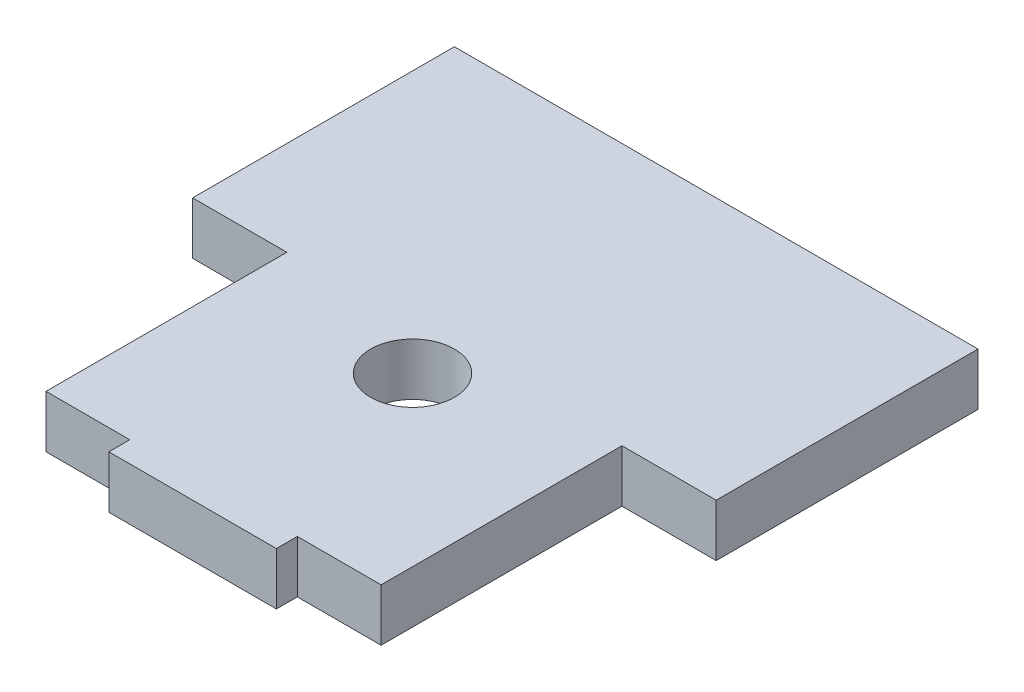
from build123d import *

# Parameters (mm, degrees)
SKETCH1_R      = 4
EXTRUDE1_DEPTH = 5


with BuildPart() as part:
    # Sketch1 → Extrude1 (new body)
    with BuildSketch(Plane(origin=(0, 0, 0), x_dir=(1, 0, 0), z_dir=(0, 1, 0))):
        Polygon((9, 2), (9, 25), (0, 25), (0, 50), (50, 50), (50, 25), (41, 25), (41, 2), (33, 2), (33, 0), (17, 0), (17, 2), align=None)
        with Locations(Location((25, 21, 0), (0, 0, 270))):
            Circle(SKETCH1_R, mode=Mode.SUBTRACT)
    extrude(amount=EXTRUDE1_DEPTH)


solid = part.part
